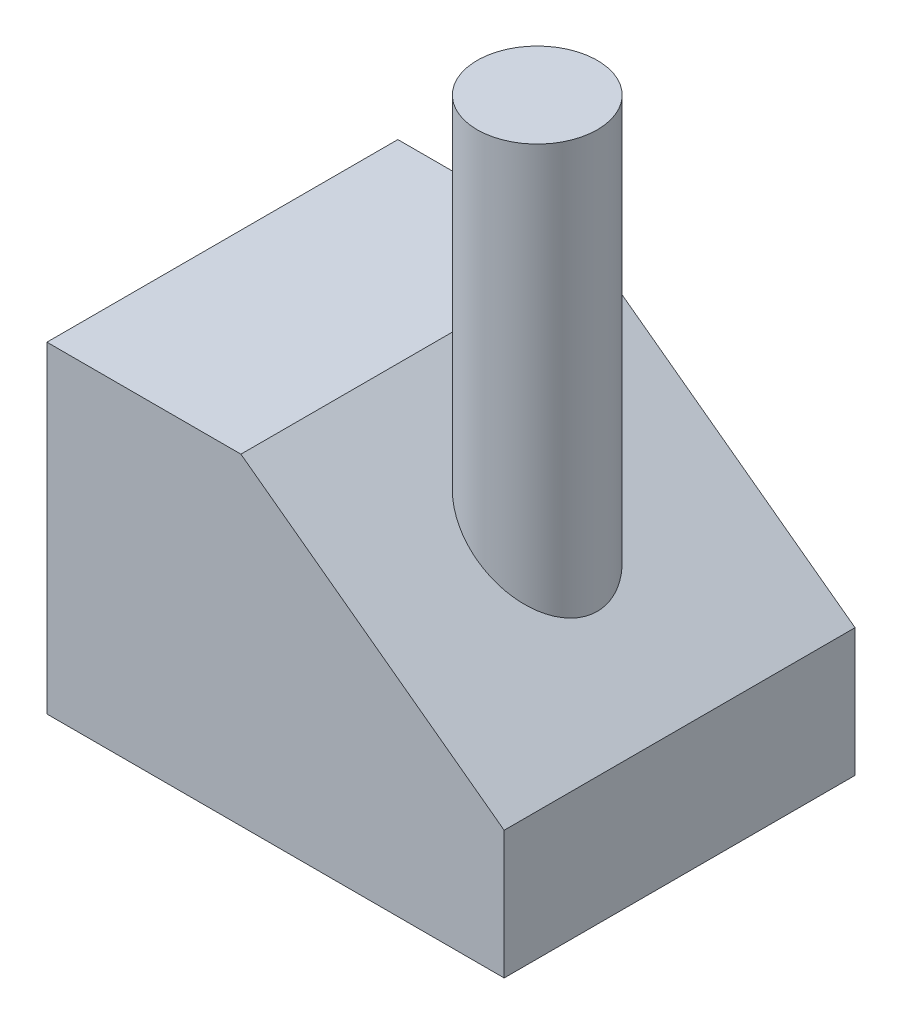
from build123d import *

# Parameters (mm, degrees)
EXTRUDE1_DEPTH = 42
SKETCH3_R      = 14.381046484
EXTRUDE2_DEPTH = 145


with BuildPart() as part:
    # Sketch2 → Extrude1 (new, symmetric)
    with BuildSketch(Plane.XY):
        Polygon((0, 0), (109.444117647, 0), (109.444117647, 30.629411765), (46.437844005, 77.089733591), (0, 77.089733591), align=None)
    extrude(amount=EXTRUDE1_DEPTH, both=True)

    # Sketch3 → Extrude2 (add)
    with BuildSketch(Plane(origin=(0, 0, 0), x_dir=(1, 0, 0), z_dir=(0, 1, 0))):
        with Locations((75.368824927, 0)):
            Circle(SKETCH3_R)
    extrude(amount=EXTRUDE2_DEPTH)


solid = part.part
